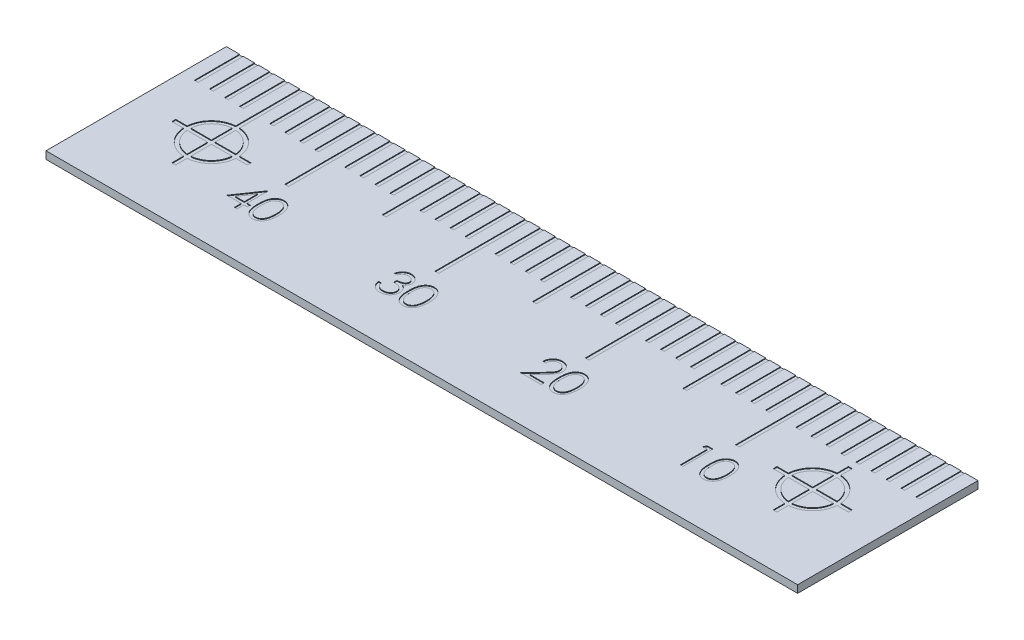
from build123d import *

# Parameters (mm, degrees)
SKETCH1_W           = 50
SKETCH1_H           = 12
BOSS_EXTRUDE1_DEPTH = 0.5
SKETCH2_W           = 0.25
SKETCH2_H           = 3
CUT_EXTRUDE2_DEPTH  = 0.05
LPATTERN2_COUNT     = 49
LPATTERN2_PITCH     = 1
SKETCH3_W           = 0.25
SKETCH3_H           = 3
CUT_EXTRUDE3_DEPTH  = 0.05
LPATTERN3_COUNT     = 4
LPATTERN3_PITCH     = 10
SKETCH4_W           = 0.25
SKETCH4_H           = 1.5
CUT_EXTRUDE4_DEPTH  = 0.05
LPATTERN4_COUNT     = 3
LPATTERN4_PITCH     = 10
LPATTERN4_COL_COUNT = 2
LPATTERN4_COL_PITCH = 10
CUT_EXTRUDE6_DEPTH  = 0.05
LPATTERN5_COUNT     = 2
LPATTERN5_PITCH     = 40
CUT_EXTRUDE12_DEPTH = 0.05


with BuildPart() as part:
    # Sketch1 → Boss-Extrude1 (new body)
    with BuildSketch(Plane(origin=(0, 0, 0), x_dir=(1, 0, 0), z_dir=(0, 1, 0))):
        Rectangle(SKETCH1_W, SKETCH1_H)
    extrude(amount=-BOSS_EXTRUDE1_DEPTH)

    # Sketch2 → Cut-Extrude2 (cut)
    with BuildSketch(Plane(origin=(0, 0, 0), x_dir=(1, 0, 0), z_dir=(0, 1, 0))):
        with Locations((-24, 4.5)):
            Rectangle(SKETCH2_W, SKETCH2_H)
    cut_extrude2 = extrude(amount=-CUT_EXTRUDE2_DEPTH, mode=Mode.SUBTRACT)

    # LPattern2: Cut-Extrude2 ×49
    with Locations(*[(i * LPATTERN2_PITCH, 0, 0) for i in range(1, LPATTERN2_COUNT)]):
        add(cut_extrude2, mode=Mode.SUBTRACT)

    # Sketch3 → Cut-Extrude3 (cut)
    with BuildSketch(Plane(origin=(0, 0, 0), x_dir=(1, 0, 0), z_dir=(0, 1, 0))):
        with Locations((-15, 1.5)):
            Rectangle(SKETCH3_W, SKETCH3_H)
    cut_extrude3 = extrude(amount=-CUT_EXTRUDE3_DEPTH, mode=Mode.SUBTRACT)

    # LPattern3: Cut-Extrude3 ×4
    with Locations(*[(i * LPATTERN3_PITCH, 0, 0) for i in range(1, LPATTERN3_COUNT)]):
        add(cut_extrude3, mode=Mode.SUBTRACT)

    # Sketch4 → Cut-Extrude4 (cut)
    with BuildSketch(Plane(origin=(0, 0, 0), x_dir=(1, 0, 0), z_dir=(0, 1, 0))):
        with Locations((-10, 2.25)):
            Rectangle(SKETCH4_W, SKETCH4_H)
    cut_extrude4 = extrude(amount=-CUT_EXTRUDE4_DEPTH, mode=Mode.SUBTRACT)

    # LPattern4: Cut-Extrude4 ×3
    with Locations(*[(i * LPATTERN4_PITCH, 0, 0) for i in range(1, LPATTERN4_COUNT)]):
        add(cut_extrude4, mode=Mode.SUBTRACT)

    # LPattern4 col: Cut-Extrude4 ×2
    with Locations(*[(-i * LPATTERN4_COL_PITCH, 0, 0) for i in range(1, LPATTERN4_COL_COUNT)]):
        add(cut_extrude4, mode=Mode.SUBTRACT)

    # Sketch5 → Cut-Extrude6 (cut)
    with BuildSketch(Plane(origin=(0, 0, 0), x_dir=(1, 0, 0), z_dir=(0, 1, 0))):
        with BuildLine():
            Line((-20.12, 2.5), (-19.87, 2.5))
            Line((-19.87, 2.5), (-19.87, 1.745530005))
            ThreePointArc((-19.87, 1.745530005), (-18.757563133, 1.237436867), (-18.249469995, 0.125))
            Line((-18.249469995, 0.125), (-17.495, 0.125))
            Line((-17.495, 0.125), (-17.495, -0.125))
            Line((-17.495, -0.125), (-18.249469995, -0.125))
            ThreePointArc((-18.249469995, -0.125), (-18.757563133, -1.237436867), (-19.87, -1.745530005))
            Line((-19.87, -1.745530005), (-19.87, -2.5))
            Line((-19.87, -2.5), (-20.12, -2.5))
            Line((-20.12, -2.5), (-20.12, -1.745530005))
            ThreePointArc((-20.12, -1.745530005), (-21.232436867, -1.237436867), (-21.740530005, -0.125))
            Line((-21.740530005, -0.125), (-22.495, -0.125))
            Line((-22.495, -0.125), (-22.495, 0.125))
            Line((-22.495, 0.125), (-21.740530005, 0.125))
            ThreePointArc((-21.740530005, 0.125), (-21.232436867, 1.237436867), (-20.12, 1.745530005))
            Line((-20.12, 1.745530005), (-20.12, 2.5))
        make_face()
        with BuildLine():
            Line((-20.12, 1.494782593), (-20.12, 0.125))
            Line((-20.12, 0.125), (-21.489782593, 0.125))
            ThreePointArc((-21.489782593, 0.125), (-21.055660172, 1.060660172), (-20.12, 1.494782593))
        make_face(mode=Mode.SUBTRACT)
        with BuildLine():
            Line((-19.87, 1.494782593), (-19.87, 0.125))
            Line((-19.87, 0.125), (-18.500217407, 0.125))
            ThreePointArc((-18.500217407, 0.125), (-18.934339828, 1.060660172), (-19.87, 1.494782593))
        make_face(mode=Mode.SUBTRACT)
        with BuildLine():
            Line((-21.489782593, -0.125), (-20.12, -0.125))
            Line((-20.12, -0.125), (-20.12, -1.494782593))
            ThreePointArc((-20.12, -1.494782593), (-21.055660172, -1.060660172), (-21.489782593, -0.125))
        make_face(mode=Mode.SUBTRACT)
        with BuildLine():
            Line((-19.87, -0.125), (-19.87, -1.494782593))
            ThreePointArc((-19.87, -1.494782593), (-18.934339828, -1.060660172), (-18.500217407, -0.125))
            Line((-18.500217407, -0.125), (-19.87, -0.125))
        make_face(mode=Mode.SUBTRACT)
    cut_extrude6 = extrude(amount=-CUT_EXTRUDE6_DEPTH, mode=Mode.SUBTRACT)

    # LPattern5: Cut-Extrude6 ×2
    with Locations(*[(i * LPATTERN5_PITCH, 0, 0) for i in range(1, LPATTERN5_COUNT)]):
        add(cut_extrude6, mode=Mode.SUBTRACT)

    # Sketch15 → Cut-Extrude12 (cut)
    # profile 1 of 8: a face of its own
    with BuildSketch(Plane(origin=(0, 0, 0), x_dir=(1, 0, 0), z_dir=(0, 1, 0))):
        Polygon((-15.331330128, -0.948717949), (-15.294871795, -0.948717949), (-15.294871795, -2.333333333), (-15.064102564, -2.333333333), (-15.064102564, -2.538461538), (-15.294871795, -2.538461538), (-15.294871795, -3), (-15.474358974, -3), (-15.474358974, -2.538461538), (-16.423076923, -2.538461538), align=None)
        Polygon((-15.474358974, -2.333333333), (-15.474358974, -1.46474359), (-16.070512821, -2.333333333), align=None, mode=Mode.SUBTRACT)
    # profile 2 of 8: a face of its own
    with BuildSketch(Plane(origin=(0, 0, 0), x_dir=(1, 0, 0), z_dir=(0, 1, 0))):
        with BuildLine():
            add(Edge.make_bspline(
                [(-14.884615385, -2.000801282), (-14.884427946, -1.968745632), (-14.884063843, -1.906477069), (-14.880013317, -1.815742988), (-14.87328455, -1.730622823), (-14.864063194, -1.6511125), (-14.852841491, -1.577191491), (-14.837861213, -1.509057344), (-14.820825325, -1.446394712), (-14.801081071, -1.388999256), (-14.778802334, -1.336097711), (-14.754554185, -1.286711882), (-14.727374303, -1.240916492), (-14.698816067, -1.197980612), (-14.667723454, -1.158607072), (-14.634981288, -1.122239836), (-14.599311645, -1.089719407), (-14.561927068, -1.060092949), (-14.522489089, -1.034121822), (-14.482121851, -1.011245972), (-14.440547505, -0.99170319), (-14.397652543, -0.976337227), (-14.35382251, -0.963645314), (-14.308904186, -0.954965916), (-14.262823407, -0.949504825), (-14.23171973, -0.948982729), (-14.215945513, -0.948717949)],
                knots=[0, 0, 0, 0, 1.646270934, 3.197905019, 4.663502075, 6.030701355, 7.308322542, 8.50163776, 9.611534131, 10.641858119, 11.616356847, 12.558055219, 13.465016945, 14.349605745, 15.204443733, 16.039544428, 16.859896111, 17.680448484, 18.487036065, 19.28249412, 20.06191084, 20.843045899, 21.620316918, 22.403196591, 23.190181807, 24, 24, 24, 24], degree=3))
            add(Edge.make_bspline(
                [(-14.215945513, -0.948717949), (-14.200039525, -0.9489967), (-14.16840752, -0.949551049), (-14.121641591, -0.954879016), (-14.075956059, -0.963719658), (-14.031545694, -0.976245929), (-13.988045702, -0.991786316), (-13.945796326, -1.011264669), (-13.904535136, -1.033938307), (-13.864917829, -1.060580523), (-13.826509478, -1.090284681), (-13.790253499, -1.123863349), (-13.756146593, -1.160977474), (-13.723760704, -1.201229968), (-13.694014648, -1.245392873), (-13.665686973, -1.292698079), (-13.640331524, -1.343972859), (-13.615911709, -1.398361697), (-13.594833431, -1.457369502), (-13.575824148, -1.520663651), (-13.560464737, -1.588991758), (-13.547670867, -1.661995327), (-13.537759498, -1.73994246), (-13.530540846, -1.822666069), (-13.526727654, -1.910220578), (-13.526009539, -1.970082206), (-13.525641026, -2.000801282)],
                knots=[0, 0, 0, 0, 0.810914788, 1.612654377, 2.396697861, 3.181598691, 3.963628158, 4.749916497, 5.551656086, 6.361998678, 7.18212741, 8.025565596, 8.878627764, 9.750805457, 10.657531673, 11.591944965, 12.560506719, 13.57287815, 14.630710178, 15.753379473, 16.941251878, 18.199788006, 19.531962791, 20.947069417, 22.433333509, 24, 24, 24, 24], degree=3))
            add(Edge.make_bspline(
                [(-13.525641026, -2.000801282), (-13.52601336, -2.031386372), (-13.526738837, -2.090980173), (-13.530498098, -2.178140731), (-13.53790303, -2.260425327), (-13.547165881, -2.338031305), (-13.559995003, -2.410635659), (-13.575769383, -2.47848963), (-13.593283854, -2.541886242), (-13.614903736, -2.600306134), (-13.638566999, -2.654564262), (-13.664312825, -2.705231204), (-13.691895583, -2.752754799), (-13.721946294, -2.796754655), (-13.753976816, -2.837542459), (-13.788672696, -2.874398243), (-13.825055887, -2.908210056), (-13.863577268, -2.9382967), (-13.90381244, -2.964630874), (-13.944931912, -2.988181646), (-13.987665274, -3.007171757), (-14.031044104, -3.023477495), (-14.075688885, -3.035934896), (-14.121543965, -3.044548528), (-14.1683761, -3.050589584), (-14.200034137, -3.05105043), (-14.215945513, -3.051282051)],
                knots=[0, 0, 0, 0, 1.561518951, 3.042555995, 4.452378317, 5.7783523, 7.031515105, 8.214008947, 9.334062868, 10.386615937, 11.391082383, 12.354592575, 13.286541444, 14.194233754, 15.072674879, 15.931287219, 16.775624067, 17.606195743, 18.42308326, 19.229000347, 20.022332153, 20.807536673, 21.593273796, 22.3848459, 23.188221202, 24, 24, 24, 24], degree=3))
            add(Edge.make_bspline(
                [(-14.215945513, -3.051282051), (-14.231719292, -3.051015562), (-14.262822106, -3.050490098), (-14.308909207, -3.04505368), (-14.353642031, -3.036313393), (-14.397241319, -3.024075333), (-14.439930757, -3.009095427), (-14.481128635, -2.989579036), (-14.521293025, -2.967102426), (-14.560316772, -2.941505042), (-14.597466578, -2.912178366), (-14.632951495, -2.879741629), (-14.665880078, -2.843385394), (-14.696528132, -2.803683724), (-14.725656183, -2.761001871), (-14.75245011, -2.714757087), (-14.777233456, -2.665132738), (-14.799886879, -2.611808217), (-14.819971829, -2.554005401), (-14.837713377, -2.491063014), (-14.851721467, -2.422425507), (-14.863711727, -2.348644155), (-14.873382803, -2.269401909), (-14.879985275, -2.18465575), (-14.884066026, -2.094458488), (-14.884428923, -2.032590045), (-14.884615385, -2.000801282)],
                knots=[0, 0, 0, 0, 0.810891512, 1.598919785, 2.382837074, 3.152667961, 3.926044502, 4.706494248, 5.493654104, 6.291793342, 7.103789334, 7.925228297, 8.761435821, 9.622817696, 10.50288917, 11.416980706, 12.369136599, 13.353924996, 14.394355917, 15.514179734, 16.714354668, 17.994756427, 19.357759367, 20.818452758, 22.365282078, 24, 24, 24, 24], degree=3))
        make_face()
        with BuildLine():
            add(Edge.make_bspline(
                [(-14.705128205, -2), (-14.70505995, -2.026713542), (-14.704927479, -2.078559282), (-14.701466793, -2.153898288), (-14.696752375, -2.224167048), (-14.690671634, -2.289454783), (-14.681641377, -2.349540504), (-14.671523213, -2.404837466), (-14.659210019, -2.45505303), (-14.644641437, -2.500531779), (-14.628047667, -2.542045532), (-14.609930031, -2.580674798), (-14.590466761, -2.616875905), (-14.568684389, -2.650323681), (-14.544961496, -2.681127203), (-14.519833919, -2.709831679), (-14.492363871, -2.735429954), (-14.454361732, -2.766131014), (-14.404192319, -2.797856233), (-14.34098063, -2.82548257), (-14.276027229, -2.842843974), (-14.231940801, -2.845051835), (-14.209935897, -2.846153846)],
                knots=[0, 0, 0, 0, 1.459021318, 2.831673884, 4.118529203, 5.306027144, 6.411944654, 7.436330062, 8.375795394, 9.233974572, 10.042671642, 10.816086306, 11.563610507, 12.285937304, 12.993564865, 13.685989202, 14.367179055, 15.041617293, 16.353048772, 17.594441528, 18.799311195, 20, 20, 20, 20], degree=3))
            add(Edge.make_bspline(
                [(-14.209935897, -2.846153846), (-14.187788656, -2.845240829), (-14.1435399, -2.843416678), (-14.078892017, -2.8258174), (-14.016131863, -2.799263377), (-13.966947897, -2.767864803), (-13.929529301, -2.7379629), (-13.902719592, -2.712468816), (-13.878112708, -2.683922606), (-13.854774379, -2.653123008), (-13.833369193, -2.619481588), (-13.813904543, -2.583160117), (-13.79614263, -2.544057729), (-13.786023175, -2.516760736), (-13.780849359, -2.502804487)],
                knots=[0, 0, 0, 0, 1.353760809, 2.704726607, 4.075137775, 5.516104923, 6.260822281, 7.007110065, 7.778089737, 8.566572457, 9.372053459, 10.217411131, 11.088608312, 12, 12, 12, 12], degree=3))
            add(Edge.make_bspline(
                [(-13.780849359, -2.502804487), (-13.774819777, -2.484958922), (-13.762577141, -2.448724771), (-13.746798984, -2.39251697), (-13.734373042, -2.333543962), (-13.723193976, -2.272158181), (-13.715563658, -2.207906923), (-13.70942205, -2.140988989), (-13.705804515, -2.071353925), (-13.705356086, -2.024042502), (-13.705128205, -2)],
                knots=[0, 0, 0, 0, 0.884706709, 1.796334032, 2.740027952, 3.714592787, 4.726048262, 5.777819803, 6.87074269, 8, 8, 8, 8], degree=3))
            add(Edge.make_bspline(
                [(-13.705128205, -2), (-13.705442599, -1.975961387), (-13.706057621, -1.928936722), (-13.708408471, -1.86006919), (-13.714479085, -1.794659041), (-13.721221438, -1.732424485), (-13.731162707, -1.673710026), (-13.741881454, -1.618024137), (-13.756282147, -1.566056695), (-13.771664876, -1.516994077), (-13.789270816, -1.471393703), (-13.808651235, -1.429042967), (-13.829349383, -1.38973741), (-13.851830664, -1.353584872), (-13.875828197, -1.320423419), (-13.901975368, -1.290917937), (-13.929235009, -1.264153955), (-13.967416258, -1.233603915), (-14.017401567, -1.202454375), (-14.07959908, -1.173788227), (-14.144325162, -1.157326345), (-14.188081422, -1.155005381), (-14.209935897, -1.153846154)],
                knots=[0, 0, 0, 0, 1.31362396, 2.569729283, 3.763502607, 4.902122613, 5.988968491, 7.01645872, 7.998833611, 8.933434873, 9.825090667, 10.667526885, 11.477055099, 12.250526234, 12.991942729, 13.710640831, 14.402115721, 15.076753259, 16.378508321, 17.609869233, 18.806226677, 20, 20, 20, 20], degree=3))
            add(Edge.make_bspline(
                [(-14.209935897, -1.153846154), (-14.232056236, -1.155006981), (-14.27633721, -1.157330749), (-14.341736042, -1.173726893), (-14.404424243, -1.202305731), (-14.454277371, -1.233707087), (-14.492485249, -1.263614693), (-14.519389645, -1.28954981), (-14.544616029, -1.317919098), (-14.567854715, -1.349005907), (-14.58962002, -1.382414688), (-14.60960917, -1.418408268), (-14.627619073, -1.457169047), (-14.644238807, -1.498664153), (-14.658851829, -1.544138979), (-14.670905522, -1.594292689), (-14.682040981, -1.64941377), (-14.689923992, -1.709824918), (-14.696931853, -1.775129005), (-14.70143548, -1.845573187), (-14.704939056, -1.921038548), (-14.705063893, -1.973152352), (-14.705128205, -2)],
                knots=[0, 0, 0, 0, 1.207732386, 2.417664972, 3.655092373, 4.956220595, 5.625982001, 6.301752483, 6.994047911, 7.697131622, 8.419323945, 9.170223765, 9.943494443, 10.752040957, 11.610060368, 12.549350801, 13.567764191, 14.679664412, 15.874934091, 17.154273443, 18.533957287, 20, 20, 20, 20], degree=3))
        make_face(mode=Mode.SUBTRACT)
    # profile 3 of 8: a face of its own
    with BuildSketch(Plane(origin=(0, 0, 0), x_dir=(1, 0, 0), z_dir=(0, 1, 0))):
        with BuildLine():
            Line((-6.166666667, -1.461538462), (-6.346153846, -1.461538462))
            add(Edge.make_bspline(
                [(-6.346153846, -1.461538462), (-6.341291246, -1.441405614), (-6.33178526, -1.402047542), (-6.311958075, -1.345814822), (-6.2903585, -1.292601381), (-6.264421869, -1.243403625), (-6.236131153, -1.197232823), (-6.203718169, -1.155136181), (-6.168678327, -1.116043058), (-6.129921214, -1.081349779), (-6.089276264, -1.049933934), (-6.046170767, -1.023148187), (-6.001471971, -1.000105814), (-5.95487018, -0.981122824), (-5.906226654, -0.966822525), (-5.855981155, -0.956447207), (-5.804002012, -0.949709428), (-5.768717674, -0.949051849), (-5.750801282, -0.948717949)],
                knots=[0, 0, 0, 0, 1.162005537, 2.271625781, 3.343758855, 4.383309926, 5.390229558, 6.379919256, 7.361854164, 8.333198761, 9.295911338, 10.242430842, 11.177959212, 12.116337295, 13.062827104, 14.020064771, 14.994644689, 16, 16, 16, 16], degree=3))
            add(Edge.make_bspline(
                [(-5.750801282, -0.948717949), (-5.724696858, -0.94950608), (-5.673057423, -0.951065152), (-5.597192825, -0.965301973), (-5.524034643, -0.98783062), (-5.454383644, -1.018958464), (-5.389687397, -1.057351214), (-5.332123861, -1.10304535), (-5.282473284, -1.155159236), (-5.240819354, -1.212720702), (-5.208205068, -1.274238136), (-5.184155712, -1.337552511), (-5.169514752, -1.402513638), (-5.167617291, -1.44637494), (-5.166666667, -1.468349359)],
                knots=[0, 0, 0, 0, 1.083050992, 2.142477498, 3.193116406, 4.255571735, 5.30263384, 6.308962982, 7.297363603, 8.282367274, 9.249857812, 10.179914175, 11.08814088, 12, 12, 12, 12], degree=3))
            add(Edge.make_bspline(
                [(-5.166666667, -1.468349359), (-5.167331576, -1.489496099), (-5.1686327, -1.530876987), (-5.179680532, -1.591289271), (-5.198272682, -1.648227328), (-5.224026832, -1.70193085), (-5.257364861, -1.75205933), (-5.297749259, -1.798725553), (-5.345465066, -1.8421365), (-5.381624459, -1.867004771), (-5.400240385, -1.879807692)],
                knots=[0, 0, 0, 0, 1.024540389, 2.004866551, 2.965041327, 3.920577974, 4.882998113, 5.874504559, 6.905732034, 8, 8, 8, 8], degree=3))
            add(Edge.make_bspline(
                [(-5.400240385, -1.879807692), (-5.378965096, -1.890080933), (-5.336812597, -1.910435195), (-5.279355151, -1.95035277), (-5.227196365, -1.996442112), (-5.198108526, -2.032409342), (-5.18349359, -2.050480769)],
                knots=[0, 0, 0, 0, 1.015518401, 2.012035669, 3.001164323, 4, 4, 4, 4], degree=3))
            add(Edge.make_bspline(
                [(-5.18349359, -2.050480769), (-5.173869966, -2.063656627), (-5.154780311, -2.08979258), (-5.131217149, -2.131813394), (-5.109840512, -2.17429996), (-5.093183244, -2.218391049), (-5.080283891, -2.263575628), (-5.071063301, -2.309931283), (-5.065335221, -2.357495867), (-5.064514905, -2.389674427), (-5.064102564, -2.405849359)],
                knots=[0, 0, 0, 0, 1.025084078, 2.033381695, 3.024893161, 4.013698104, 4.991890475, 5.976764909, 6.982997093, 8, 8, 8, 8], degree=3))
            add(Edge.make_bspline(
                [(-5.064102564, -2.405849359), (-5.065128, -2.433854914), (-5.067174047, -2.489734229), (-5.08546209, -2.572291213), (-5.113812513, -2.6529915), (-5.154073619, -2.730177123), (-5.203140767, -2.802394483), (-5.261516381, -2.867009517), (-5.328537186, -2.922551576), (-5.403283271, -2.968957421), (-5.484264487, -3.006053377), (-5.570879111, -3.031800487), (-5.661879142, -3.048569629), (-5.724283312, -3.05036784), (-5.756009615, -3.051282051)],
                knots=[0, 0, 0, 0, 0.955779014, 1.907060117, 2.875433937, 3.871313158, 4.872415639, 5.851225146, 6.836215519, 7.83643374, 8.849228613, 9.86973379, 10.916971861, 12, 12, 12, 12], degree=3))
            add(Edge.make_bspline(
                [(-5.756009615, -3.051282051), (-5.777392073, -3.050785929), (-5.819465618, -3.049809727), (-5.881319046, -3.043136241), (-5.940360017, -3.030947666), (-5.996668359, -3.014545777), (-6.050294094, -2.993750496), (-6.101073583, -2.967854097), (-6.149319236, -2.937390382), (-6.194575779, -2.90199976), (-6.236837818, -2.862410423), (-6.274982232, -2.81791956), (-6.309644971, -2.769349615), (-6.339897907, -2.71613644), (-6.367119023, -2.658967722), (-6.389508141, -2.597111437), (-6.40921418, -2.531120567), (-6.41837616, -2.485133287), (-6.423076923, -2.461538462)],
                knots=[0, 0, 0, 0, 1.048658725, 2.063410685, 3.046034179, 4.001477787, 4.936774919, 5.862367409, 6.792675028, 7.730719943, 8.675894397, 9.627829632, 10.600096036, 11.597688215, 12.626045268, 13.701542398, 14.82072376, 16, 16, 16, 16], degree=3))
            Line((-6.423076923, -2.461538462), (-6.243589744, -2.461538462))
            add(Edge.make_bspline(
                [(-6.243589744, -2.461538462), (-6.238913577, -2.476937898), (-6.229818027, -2.506891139), (-6.214335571, -2.549999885), (-6.196696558, -2.589518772), (-6.177773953, -2.625737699), (-6.157900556, -2.659013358), (-6.135663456, -2.688465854), (-6.112709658, -2.715388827), (-6.095407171, -2.730557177), (-6.086939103, -2.737980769)],
                knots=[0, 0, 0, 0, 1.198163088, 2.33053128, 3.407730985, 4.417276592, 5.372219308, 6.28897303, 7.162600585, 8, 8, 8, 8], degree=3))
            add(Edge.make_bspline(
                [(-6.086939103, -2.737980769), (-6.075741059, -2.746614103), (-6.053379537, -2.763854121), (-6.016940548, -2.785855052), (-5.978617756, -2.804918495), (-5.937580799, -2.819480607), (-5.894715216, -2.831810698), (-5.84932815, -2.839879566), (-5.801820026, -2.845415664), (-5.769381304, -2.845904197), (-5.752804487, -2.846153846)],
                knots=[0, 0, 0, 0, 0.946170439, 1.889420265, 2.845303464, 3.807233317, 4.801018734, 5.828864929, 6.890507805, 8, 8, 8, 8], degree=3))
            add(Edge.make_bspline(
                [(-5.752804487, -2.846153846), (-5.7340882, -2.8458019), (-5.697490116, -2.845113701), (-5.644087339, -2.838784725), (-5.593283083, -2.829567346), (-5.545641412, -2.815331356), (-5.500538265, -2.797742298), (-5.458605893, -2.775657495), (-5.419293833, -2.749746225), (-5.383105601, -2.720295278), (-5.350565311, -2.688054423), (-5.321914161, -2.654332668), (-5.297557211, -2.619272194), (-5.277909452, -2.582678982), (-5.262394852, -2.544704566), (-5.251833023, -2.505242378), (-5.2444893, -2.464615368), (-5.243891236, -2.436998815), (-5.243589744, -2.423076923)],
                knots=[0, 0, 0, 0, 1.217147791, 2.380027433, 3.494444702, 4.572153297, 5.609568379, 6.639424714, 7.649109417, 8.668170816, 9.669597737, 10.625200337, 11.543417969, 12.441394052, 13.322311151, 14.205496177, 15.095365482, 16, 16, 16, 16], degree=3))
            add(Edge.make_bspline(
                [(-5.243589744, -2.423076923), (-5.244464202, -2.404441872), (-5.246208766, -2.367264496), (-5.259527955, -2.312568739), (-5.281435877, -2.259869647), (-5.312105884, -2.210066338), (-5.349440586, -2.16390868), (-5.393077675, -2.122724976), (-5.44337952, -2.088742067), (-5.489676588, -2.065262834), (-5.530685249, -2.049241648), (-5.565779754, -2.03857024), (-5.605069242, -2.029533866), (-5.648078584, -2.021126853), (-5.695131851, -2.013971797), (-5.746177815, -2.008005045), (-5.801226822, -2.003230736), (-5.83933606, -2.001098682), (-5.858974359, -2)],
                knots=[0, 0, 0, 0, 1.07054697, 2.135767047, 3.216561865, 4.33974944, 5.486079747, 6.621378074, 7.775625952, 8.963672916, 9.598146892, 10.304877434, 11.070270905, 11.915000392, 12.823868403, 13.805723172, 14.86925407, 16, 16, 16, 16], degree=3))
            Line((-5.858974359, -2), (-5.858974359, -1.794871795))
            add(Edge.make_bspline(
                [(-5.858974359, -1.794871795), (-5.834230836, -1.794451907), (-5.785764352, -1.79362945), (-5.714967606, -1.783682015), (-5.647268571, -1.769921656), (-5.584167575, -1.748844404), (-5.526654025, -1.724364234), (-5.476757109, -1.695877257), (-5.435175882, -1.664211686), (-5.402112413, -1.628878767), (-5.377238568, -1.590984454), (-5.359051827, -1.551489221), (-5.348308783, -1.5100469), (-5.346874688, -1.481764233), (-5.346153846, -1.467548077)],
                knots=[0, 0, 0, 0, 1.321986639, 2.589447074, 3.816329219, 5.01088745, 6.139805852, 7.153945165, 8.075214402, 8.924034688, 9.728124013, 10.488707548, 11.240355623, 12, 12, 12, 12], degree=3))
            add(Edge.make_bspline(
                [(-5.346153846, -1.467548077), (-5.346390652, -1.457103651), (-5.346861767, -1.436324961), (-5.352803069, -1.405967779), (-5.361731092, -1.376538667), (-5.374005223, -1.348162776), (-5.390433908, -1.321036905), (-5.410094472, -1.294929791), (-5.433504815, -1.269990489), (-5.460330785, -1.246744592), (-5.48913753, -1.224590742), (-5.52070883, -1.20578295), (-5.554092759, -1.189700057), (-5.589326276, -1.176437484), (-5.626523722, -1.166460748), (-5.665510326, -1.15929741), (-5.706360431, -1.154818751), (-5.734229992, -1.154173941), (-5.748397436, -1.153846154)],
                knots=[0, 0, 0, 0, 0.884392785, 1.759457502, 2.611959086, 3.489218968, 4.37281399, 5.2945488, 6.255912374, 7.266815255, 8.301784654, 9.332968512, 10.37626691, 11.440494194, 12.520033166, 13.637162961, 14.798855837, 16, 16, 16, 16], degree=3))
            add(Edge.make_bspline(
                [(-5.748397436, -1.153846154), (-5.771169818, -1.154641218), (-5.815649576, -1.156194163), (-5.879772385, -1.169795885), (-5.939383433, -1.191497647), (-5.984948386, -1.217402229), (-6.018595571, -1.242973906), (-6.042639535, -1.265306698), (-6.066251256, -1.290125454), (-6.087877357, -1.318958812), (-6.109748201, -1.34985412), (-6.129659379, -1.384381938), (-6.149007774, -1.421641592), (-6.160666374, -1.447981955), (-6.166666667, -1.461538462)],
                knots=[0, 0, 0, 0, 1.472543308, 2.876219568, 4.221790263, 5.565193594, 6.249813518, 6.953379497, 7.687249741, 8.463570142, 9.283606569, 10.136032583, 11.040678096, 12, 12, 12, 12], degree=3))
        make_face()
    # profile 4 of 8: a face of its own
    with BuildSketch(Plane(origin=(0, 0, 0), x_dir=(1, 0, 0), z_dir=(0, 1, 0))):
        with BuildLine():
            add(Edge.make_bspline(
                [(-4.884615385, -2.000801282), (-4.884427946, -1.968745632), (-4.884063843, -1.906477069), (-4.880013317, -1.815742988), (-4.87328455, -1.730622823), (-4.864063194, -1.6511125), (-4.852841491, -1.577191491), (-4.837861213, -1.509057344), (-4.820825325, -1.446394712), (-4.801081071, -1.388999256), (-4.778802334, -1.336097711), (-4.754554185, -1.286711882), (-4.727374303, -1.240916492), (-4.698816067, -1.197980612), (-4.667723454, -1.158607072), (-4.634981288, -1.122239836), (-4.599311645, -1.089719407), (-4.561927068, -1.060092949), (-4.522489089, -1.034121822), (-4.482121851, -1.011245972), (-4.440547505, -0.99170319), (-4.397652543, -0.976337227), (-4.35382251, -0.963645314), (-4.308904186, -0.954965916), (-4.262823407, -0.949504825), (-4.23171973, -0.948982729), (-4.215945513, -0.948717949)],
                knots=[0, 0, 0, 0, 1.646270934, 3.197905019, 4.663502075, 6.030701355, 7.308322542, 8.50163776, 9.611534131, 10.641858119, 11.616356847, 12.558055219, 13.465016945, 14.349605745, 15.204443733, 16.039544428, 16.859896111, 17.680448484, 18.487036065, 19.28249412, 20.06191084, 20.843045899, 21.620316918, 22.403196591, 23.190181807, 24, 24, 24, 24], degree=3))
            add(Edge.make_bspline(
                [(-4.215945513, -0.948717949), (-4.200039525, -0.9489967), (-4.16840752, -0.949551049), (-4.121641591, -0.954879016), (-4.075956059, -0.963719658), (-4.031545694, -0.976245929), (-3.988045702, -0.991786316), (-3.945796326, -1.011264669), (-3.904535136, -1.033938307), (-3.864917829, -1.060580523), (-3.826509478, -1.090284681), (-3.790253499, -1.123863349), (-3.756146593, -1.160977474), (-3.723760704, -1.201229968), (-3.694014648, -1.245392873), (-3.665686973, -1.292698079), (-3.640331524, -1.343972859), (-3.615911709, -1.398361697), (-3.594833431, -1.457369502), (-3.575824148, -1.520663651), (-3.560464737, -1.588991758), (-3.547670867, -1.661995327), (-3.537759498, -1.73994246), (-3.530540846, -1.822666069), (-3.526727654, -1.910220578), (-3.526009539, -1.970082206), (-3.525641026, -2.000801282)],
                knots=[0, 0, 0, 0, 0.810914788, 1.612654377, 2.396697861, 3.181598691, 3.963628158, 4.749916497, 5.551656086, 6.361998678, 7.18212741, 8.025565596, 8.878627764, 9.750805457, 10.657531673, 11.591944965, 12.560506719, 13.57287815, 14.630710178, 15.753379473, 16.941251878, 18.199788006, 19.531962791, 20.947069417, 22.433333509, 24, 24, 24, 24], degree=3))
            add(Edge.make_bspline(
                [(-3.525641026, -2.000801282), (-3.52601336, -2.031386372), (-3.526738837, -2.090980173), (-3.530498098, -2.178140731), (-3.53790303, -2.260425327), (-3.547165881, -2.338031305), (-3.559995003, -2.410635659), (-3.575769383, -2.47848963), (-3.593283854, -2.541886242), (-3.614903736, -2.600306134), (-3.638566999, -2.654564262), (-3.664312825, -2.705231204), (-3.691895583, -2.752754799), (-3.721946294, -2.796754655), (-3.753976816, -2.837542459), (-3.788672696, -2.874398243), (-3.825055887, -2.908210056), (-3.863577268, -2.9382967), (-3.90381244, -2.964630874), (-3.944931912, -2.988181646), (-3.987665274, -3.007171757), (-4.031044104, -3.023477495), (-4.075688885, -3.035934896), (-4.121543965, -3.044548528), (-4.1683761, -3.050589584), (-4.200034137, -3.05105043), (-4.215945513, -3.051282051)],
                knots=[0, 0, 0, 0, 1.561518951, 3.042555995, 4.452378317, 5.7783523, 7.031515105, 8.214008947, 9.334062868, 10.386615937, 11.391082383, 12.354592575, 13.286541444, 14.194233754, 15.072674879, 15.931287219, 16.775624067, 17.606195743, 18.42308326, 19.229000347, 20.022332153, 20.807536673, 21.593273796, 22.3848459, 23.188221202, 24, 24, 24, 24], degree=3))
            add(Edge.make_bspline(
                [(-4.215945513, -3.051282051), (-4.231719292, -3.051015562), (-4.262822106, -3.050490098), (-4.308909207, -3.04505368), (-4.353642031, -3.036313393), (-4.397241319, -3.024075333), (-4.439930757, -3.009095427), (-4.481128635, -2.989579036), (-4.521293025, -2.967102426), (-4.560316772, -2.941505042), (-4.597466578, -2.912178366), (-4.632951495, -2.879741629), (-4.665880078, -2.843385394), (-4.696528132, -2.803683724), (-4.725656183, -2.761001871), (-4.75245011, -2.714757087), (-4.777233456, -2.665132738), (-4.799886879, -2.611808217), (-4.819971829, -2.554005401), (-4.837713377, -2.491063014), (-4.851721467, -2.422425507), (-4.863711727, -2.348644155), (-4.873382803, -2.269401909), (-4.879985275, -2.18465575), (-4.884066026, -2.094458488), (-4.884428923, -2.032590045), (-4.884615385, -2.000801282)],
                knots=[0, 0, 0, 0, 0.810891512, 1.598919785, 2.382837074, 3.152667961, 3.926044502, 4.706494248, 5.493654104, 6.291793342, 7.103789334, 7.925228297, 8.761435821, 9.622817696, 10.50288917, 11.416980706, 12.369136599, 13.353924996, 14.394355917, 15.514179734, 16.714354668, 17.994756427, 19.357759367, 20.818452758, 22.365282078, 24, 24, 24, 24], degree=3))
        make_face()
        with BuildLine():
            add(Edge.make_bspline(
                [(-4.705128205, -2), (-4.70505995, -2.026713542), (-4.704927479, -2.078559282), (-4.701466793, -2.153898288), (-4.696752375, -2.224167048), (-4.690671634, -2.289454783), (-4.681641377, -2.349540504), (-4.671523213, -2.404837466), (-4.659210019, -2.45505303), (-4.644641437, -2.500531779), (-4.628047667, -2.542045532), (-4.609930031, -2.580674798), (-4.590466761, -2.616875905), (-4.568684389, -2.650323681), (-4.544961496, -2.681127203), (-4.519833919, -2.709831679), (-4.492363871, -2.735429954), (-4.454361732, -2.766131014), (-4.404192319, -2.797856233), (-4.34098063, -2.82548257), (-4.276027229, -2.842843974), (-4.231940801, -2.845051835), (-4.209935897, -2.846153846)],
                knots=[0, 0, 0, 0, 1.459021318, 2.831673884, 4.118529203, 5.306027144, 6.411944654, 7.436330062, 8.375795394, 9.233974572, 10.042671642, 10.816086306, 11.563610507, 12.285937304, 12.993564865, 13.685989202, 14.367179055, 15.041617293, 16.353048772, 17.594441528, 18.799311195, 20, 20, 20, 20], degree=3))
            add(Edge.make_bspline(
                [(-4.209935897, -2.846153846), (-4.187788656, -2.845240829), (-4.1435399, -2.843416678), (-4.078892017, -2.8258174), (-4.016131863, -2.799263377), (-3.966947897, -2.767864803), (-3.929529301, -2.7379629), (-3.902719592, -2.712468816), (-3.878112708, -2.683922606), (-3.854774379, -2.653123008), (-3.833369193, -2.619481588), (-3.813904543, -2.583160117), (-3.79614263, -2.544057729), (-3.786023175, -2.516760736), (-3.780849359, -2.502804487)],
                knots=[0, 0, 0, 0, 1.353760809, 2.704726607, 4.075137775, 5.516104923, 6.260822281, 7.007110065, 7.778089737, 8.566572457, 9.372053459, 10.217411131, 11.088608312, 12, 12, 12, 12], degree=3))
            add(Edge.make_bspline(
                [(-3.780849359, -2.502804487), (-3.774819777, -2.484958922), (-3.762577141, -2.448724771), (-3.746798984, -2.39251697), (-3.734373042, -2.333543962), (-3.723193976, -2.272158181), (-3.715563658, -2.207906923), (-3.70942205, -2.140988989), (-3.705804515, -2.071353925), (-3.705356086, -2.024042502), (-3.705128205, -2)],
                knots=[0, 0, 0, 0, 0.884706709, 1.796334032, 2.740027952, 3.714592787, 4.726048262, 5.777819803, 6.87074269, 8, 8, 8, 8], degree=3))
            add(Edge.make_bspline(
                [(-3.705128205, -2), (-3.705442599, -1.975961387), (-3.706057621, -1.928936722), (-3.708408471, -1.86006919), (-3.714479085, -1.794659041), (-3.721221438, -1.732424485), (-3.731162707, -1.673710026), (-3.741881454, -1.618024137), (-3.756282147, -1.566056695), (-3.771664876, -1.516994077), (-3.789270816, -1.471393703), (-3.808651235, -1.429042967), (-3.829349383, -1.38973741), (-3.851830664, -1.353584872), (-3.875828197, -1.320423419), (-3.901975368, -1.290917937), (-3.929235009, -1.264153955), (-3.967416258, -1.233603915), (-4.017401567, -1.202454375), (-4.07959908, -1.173788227), (-4.144325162, -1.157326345), (-4.188081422, -1.155005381), (-4.209935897, -1.153846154)],
                knots=[0, 0, 0, 0, 1.31362396, 2.569729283, 3.763502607, 4.902122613, 5.988968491, 7.01645872, 7.998833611, 8.933434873, 9.825090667, 10.667526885, 11.477055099, 12.250526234, 12.991942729, 13.710640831, 14.402115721, 15.076753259, 16.378508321, 17.609869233, 18.806226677, 20, 20, 20, 20], degree=3))
            add(Edge.make_bspline(
                [(-4.209935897, -1.153846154), (-4.232056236, -1.155006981), (-4.27633721, -1.157330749), (-4.341736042, -1.173726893), (-4.404424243, -1.202305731), (-4.454277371, -1.233707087), (-4.492485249, -1.263614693), (-4.519389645, -1.28954981), (-4.544616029, -1.317919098), (-4.567854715, -1.349005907), (-4.58962002, -1.382414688), (-4.60960917, -1.418408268), (-4.627619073, -1.457169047), (-4.644238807, -1.498664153), (-4.658851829, -1.544138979), (-4.670905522, -1.594292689), (-4.682040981, -1.64941377), (-4.689923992, -1.709824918), (-4.696931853, -1.775129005), (-4.70143548, -1.845573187), (-4.704939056, -1.921038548), (-4.705063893, -1.973152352), (-4.705128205, -2)],
                knots=[0, 0, 0, 0, 1.207732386, 2.417664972, 3.655092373, 4.956220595, 5.625982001, 6.301752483, 6.994047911, 7.697131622, 8.419323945, 9.170223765, 9.943494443, 10.752040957, 11.610060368, 12.549350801, 13.567764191, 14.679664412, 15.874934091, 17.154273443, 18.533957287, 20, 20, 20, 20], degree=3))
        make_face(mode=Mode.SUBTRACT)
    # profile 5 of 8: a face of its own
    with BuildSketch(Plane(origin=(0, 0, 0), x_dir=(1, 0, 0), z_dir=(0, 1, 0))):
        with BuildLine():
            Line((3.833333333, -1.615384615), (3.653846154, -1.615384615))
            add(Edge.make_bspline(
                [(3.653846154, -1.615384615), (3.655015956, -1.59157268), (3.657313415, -1.544806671), (3.668072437, -1.476621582), (3.683467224, -1.411447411), (3.70523377, -1.34980746), (3.732265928, -1.291156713), (3.764683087, -1.235728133), (3.803079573, -1.183733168), (3.846626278, -1.135653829), (3.893922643, -1.091546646), (3.944954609, -1.053457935), (3.998580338, -1.021276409), (4.054637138, -0.994372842), (4.11375746, -0.974178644), (4.175404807, -0.95919485), (4.239850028, -0.950179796), (4.283758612, -0.949210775), (4.306089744, -0.948717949)],
                knots=[0, 0, 0, 0, 1.10065271, 2.161652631, 3.183658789, 4.190468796, 5.17591951, 6.163126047, 7.15150782, 8.156236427, 9.156009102, 10.134482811, 11.092018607, 12.041330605, 13.001268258, 13.972401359, 14.968799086, 16, 16, 16, 16], degree=3))
            add(Edge.make_bspline(
                [(4.306089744, -0.948717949), (4.328020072, -0.949231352), (4.371112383, -0.950240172), (4.434004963, -0.958903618), (4.493877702, -0.972472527), (4.550613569, -0.991509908), (4.603759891, -1.017101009), (4.653715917, -1.04784246), (4.70107638, -1.083396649), (4.743708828, -1.125255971), (4.782856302, -1.169943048), (4.816629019, -1.217650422), (4.845550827, -1.266924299), (4.869658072, -1.318140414), (4.887404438, -1.371781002), (4.900877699, -1.427065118), (4.908493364, -1.48456501), (4.909662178, -1.523483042), (4.91025641, -1.543269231)],
                knots=[0, 0, 0, 0, 1.111607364, 2.184268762, 3.212621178, 4.221274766, 5.211760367, 6.196651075, 7.1921475, 8.207485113, 9.220403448, 10.201281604, 11.166441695, 12.114753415, 13.065576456, 14.026450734, 14.996634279, 16, 16, 16, 16], degree=3))
            add(Edge.make_bspline(
                [(4.91025641, -1.543269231), (4.909288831, -1.571125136), (4.907370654, -1.626348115), (4.890962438, -1.707499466), (4.865335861, -1.786124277), (4.834480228, -1.849402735), (4.803353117, -1.900393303), (4.775303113, -1.94237542), (4.742466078, -1.987578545), (4.704364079, -2.035851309), (4.661785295, -2.087571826), (4.614344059, -2.142708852), (4.561702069, -2.20069272), (4.524754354, -2.240295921), (4.505608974, -2.260817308)],
                knots=[0, 0, 0, 0, 1.184426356, 2.348067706, 3.509069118, 4.696110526, 5.333549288, 6.050745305, 6.844228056, 7.710549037, 8.667450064, 9.695053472, 10.805634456, 12, 12, 12, 12], degree=3))
            Line((4.505608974, -2.260817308), (4.005208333, -2.794871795))
            Line((4.005208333, -2.794871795), (4.935897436, -2.794871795))
            Line((4.935897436, -2.794871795), (4.935897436, -3))
            Line((4.935897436, -3), (3.576923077, -3))
            Line((3.576923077, -3), (4.352564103, -2.172275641))
            add(Edge.make_bspline(
                [(4.352564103, -2.172275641), (4.371448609, -2.152562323), (4.407721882, -2.114697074), (4.459026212, -2.059415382), (4.505105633, -2.00812993), (4.546258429, -1.960937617), (4.581591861, -1.917148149), (4.612947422, -1.878179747), (4.638070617, -1.842320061), (4.665336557, -1.800753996), (4.691744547, -1.750004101), (4.714437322, -1.68798485), (4.728274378, -1.624140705), (4.729934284, -1.580996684), (4.730769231, -1.559294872)],
                knots=[0, 0, 0, 0, 1.329631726, 2.553950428, 3.673215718, 4.687767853, 5.603093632, 6.413772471, 7.123043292, 7.734684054, 8.834405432, 9.900288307, 10.943827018, 12, 12, 12, 12], degree=3))
            add(Edge.make_bspline(
                [(4.730769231, -1.559294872), (4.730405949, -1.545648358), (4.729689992, -1.518753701), (4.723371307, -1.479321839), (4.713822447, -1.441284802), (4.700139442, -1.404525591), (4.682078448, -1.36941379), (4.660093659, -1.335906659), (4.634727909, -1.303512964), (4.605384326, -1.273139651), (4.573149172, -1.245321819), (4.539095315, -1.220679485), (4.503066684, -1.200085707), (4.465215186, -1.183203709), (4.425646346, -1.169960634), (4.384283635, -1.160784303), (4.34124134, -1.155022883), (4.311850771, -1.154243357), (4.296875, -1.153846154)],
                knots=[0, 0, 0, 0, 0.991446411, 1.95395049, 2.89581595, 3.838931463, 4.798493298, 5.75982156, 6.748411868, 7.785213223, 8.824556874, 9.840280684, 10.836137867, 11.835679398, 12.848801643, 13.863922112, 14.911575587, 16, 16, 16, 16], degree=3))
            add(Edge.make_bspline(
                [(4.296875, -1.153846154), (4.281234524, -1.154254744), (4.250519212, -1.155057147), (4.205422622, -1.160670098), (4.162402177, -1.170353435), (4.121349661, -1.183597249), (4.082195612, -1.200430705), (4.045130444, -1.221397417), (4.010237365, -1.246416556), (3.97745078, -1.274782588), (3.947242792, -1.306364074), (3.92070172, -1.341569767), (3.897510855, -1.379756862), (3.877277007, -1.420822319), (3.860845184, -1.465138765), (3.848289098, -1.512548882), (3.838353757, -1.562846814), (3.835034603, -1.597581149), (3.833333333, -1.615384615)],
                knots=[0, 0, 0, 0, 1.031018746, 2.02475058, 2.990194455, 3.934040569, 4.864654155, 5.795059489, 6.735614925, 7.690564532, 8.649604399, 9.611025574, 10.590972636, 11.591080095, 12.624614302, 13.701020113, 14.821632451, 16, 16, 16, 16], degree=3))
        make_face()
    # profile 6 of 8: a face of its own
    with BuildSketch(Plane(origin=(0, 0, 0), x_dir=(1, 0, 0), z_dir=(0, 1, 0))):
        with BuildLine():
            add(Edge.make_bspline(
                [(5.115384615, -2.000801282), (5.115572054, -1.968745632), (5.115936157, -1.906477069), (5.119986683, -1.815742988), (5.12671545, -1.730622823), (5.135936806, -1.6511125), (5.147158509, -1.577191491), (5.162138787, -1.509057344), (5.179174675, -1.446394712), (5.198918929, -1.388999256), (5.221197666, -1.336097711), (5.245445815, -1.286711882), (5.272625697, -1.240916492), (5.301183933, -1.197980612), (5.332276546, -1.158607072), (5.365018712, -1.122239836), (5.400688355, -1.089719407), (5.438072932, -1.060092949), (5.477510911, -1.034121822), (5.517878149, -1.011245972), (5.559452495, -0.99170319), (5.602347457, -0.976337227), (5.64617749, -0.963645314), (5.691095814, -0.954965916), (5.737176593, -0.949504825), (5.76828027, -0.948982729), (5.784054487, -0.948717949)],
                knots=[0, 0, 0, 0, 1.646270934, 3.197905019, 4.663502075, 6.030701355, 7.308322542, 8.50163776, 9.611534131, 10.641858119, 11.616356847, 12.558055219, 13.465016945, 14.349605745, 15.204443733, 16.039544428, 16.859896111, 17.680448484, 18.487036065, 19.28249412, 20.06191084, 20.843045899, 21.620316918, 22.403196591, 23.190181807, 24, 24, 24, 24], degree=3))
            add(Edge.make_bspline(
                [(5.784054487, -0.948717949), (5.799960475, -0.9489967), (5.83159248, -0.949551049), (5.878358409, -0.954879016), (5.924043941, -0.963719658), (5.968454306, -0.976245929), (6.011954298, -0.991786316), (6.054203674, -1.011264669), (6.095464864, -1.033938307), (6.135082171, -1.060580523), (6.173490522, -1.090284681), (6.209746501, -1.123863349), (6.243853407, -1.160977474), (6.276239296, -1.201229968), (6.305985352, -1.245392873), (6.334313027, -1.292698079), (6.359668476, -1.343972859), (6.384088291, -1.398361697), (6.405166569, -1.457369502), (6.424175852, -1.520663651), (6.439535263, -1.588991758), (6.452329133, -1.661995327), (6.462240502, -1.73994246), (6.469459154, -1.822666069), (6.473272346, -1.910220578), (6.473990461, -1.970082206), (6.474358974, -2.000801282)],
                knots=[0, 0, 0, 0, 0.810914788, 1.612654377, 2.396697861, 3.181598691, 3.963628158, 4.749916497, 5.551656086, 6.361998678, 7.18212741, 8.025565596, 8.878627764, 9.750805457, 10.657531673, 11.591944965, 12.560506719, 13.57287815, 14.630710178, 15.753379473, 16.941251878, 18.199788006, 19.531962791, 20.947069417, 22.433333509, 24, 24, 24, 24], degree=3))
            add(Edge.make_bspline(
                [(6.474358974, -2.000801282), (6.47398664, -2.031386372), (6.473261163, -2.090980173), (6.469501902, -2.178140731), (6.46209697, -2.260425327), (6.452834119, -2.338031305), (6.440004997, -2.410635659), (6.424230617, -2.47848963), (6.406716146, -2.541886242), (6.385096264, -2.600306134), (6.361433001, -2.654564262), (6.335687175, -2.705231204), (6.308104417, -2.752754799), (6.278053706, -2.796754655), (6.246023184, -2.837542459), (6.211327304, -2.874398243), (6.174944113, -2.908210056), (6.136422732, -2.9382967), (6.09618756, -2.964630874), (6.055068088, -2.988181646), (6.012334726, -3.007171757), (5.968955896, -3.023477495), (5.924311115, -3.035934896), (5.878456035, -3.044548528), (5.8316239, -3.050589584), (5.799965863, -3.05105043), (5.784054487, -3.051282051)],
                knots=[0, 0, 0, 0, 1.561518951, 3.042555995, 4.452378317, 5.7783523, 7.031515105, 8.214008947, 9.334062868, 10.386615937, 11.391082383, 12.354592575, 13.286541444, 14.194233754, 15.072674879, 15.931287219, 16.775624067, 17.606195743, 18.42308326, 19.229000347, 20.022332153, 20.807536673, 21.593273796, 22.3848459, 23.188221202, 24, 24, 24, 24], degree=3))
            add(Edge.make_bspline(
                [(5.784054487, -3.051282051), (5.768280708, -3.051015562), (5.737177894, -3.050490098), (5.691090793, -3.04505368), (5.646357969, -3.036313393), (5.602758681, -3.024075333), (5.560069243, -3.009095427), (5.518871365, -2.989579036), (5.478706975, -2.967102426), (5.439683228, -2.941505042), (5.402533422, -2.912178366), (5.367048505, -2.879741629), (5.334119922, -2.843385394), (5.303471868, -2.803683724), (5.274343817, -2.761001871), (5.24754989, -2.714757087), (5.222766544, -2.665132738), (5.200113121, -2.611808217), (5.180028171, -2.554005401), (5.162286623, -2.491063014), (5.148278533, -2.422425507), (5.136288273, -2.348644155), (5.126617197, -2.269401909), (5.120014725, -2.18465575), (5.115933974, -2.094458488), (5.115571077, -2.032590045), (5.115384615, -2.000801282)],
                knots=[0, 0, 0, 0, 0.810891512, 1.598919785, 2.382837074, 3.152667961, 3.926044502, 4.706494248, 5.493654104, 6.291793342, 7.103789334, 7.925228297, 8.761435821, 9.622817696, 10.50288917, 11.416980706, 12.369136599, 13.353924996, 14.394355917, 15.514179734, 16.714354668, 17.994756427, 19.357759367, 20.818452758, 22.365282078, 24, 24, 24, 24], degree=3))
        make_face()
        with BuildLine():
            add(Edge.make_bspline(
                [(5.294871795, -2), (5.29494005, -2.026713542), (5.295072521, -2.078559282), (5.298533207, -2.153898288), (5.303247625, -2.224167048), (5.309328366, -2.289454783), (5.318358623, -2.349540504), (5.328476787, -2.404837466), (5.340789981, -2.45505303), (5.355358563, -2.500531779), (5.371952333, -2.542045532), (5.390069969, -2.580674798), (5.409533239, -2.616875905), (5.431315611, -2.650323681), (5.455038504, -2.681127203), (5.480166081, -2.709831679), (5.507636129, -2.735429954), (5.545638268, -2.766131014), (5.595807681, -2.797856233), (5.65901937, -2.82548257), (5.723972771, -2.842843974), (5.768059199, -2.845051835), (5.790064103, -2.846153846)],
                knots=[0, 0, 0, 0, 1.459021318, 2.831673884, 4.118529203, 5.306027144, 6.411944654, 7.436330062, 8.375795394, 9.233974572, 10.042671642, 10.816086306, 11.563610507, 12.285937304, 12.993564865, 13.685989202, 14.367179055, 15.041617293, 16.353048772, 17.594441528, 18.799311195, 20, 20, 20, 20], degree=3))
            add(Edge.make_bspline(
                [(5.790064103, -2.846153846), (5.812211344, -2.845240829), (5.8564601, -2.843416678), (5.921107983, -2.8258174), (5.983868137, -2.799263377), (6.033052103, -2.767864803), (6.070470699, -2.7379629), (6.097280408, -2.712468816), (6.121887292, -2.683922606), (6.145225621, -2.653123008), (6.166630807, -2.619481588), (6.186095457, -2.583160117), (6.20385737, -2.544057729), (6.213976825, -2.516760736), (6.219150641, -2.502804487)],
                knots=[0, 0, 0, 0, 1.353760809, 2.704726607, 4.075137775, 5.516104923, 6.260822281, 7.007110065, 7.778089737, 8.566572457, 9.372053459, 10.217411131, 11.088608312, 12, 12, 12, 12], degree=3))
            add(Edge.make_bspline(
                [(6.219150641, -2.502804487), (6.225180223, -2.484958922), (6.237422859, -2.448724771), (6.253201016, -2.39251697), (6.265626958, -2.333543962), (6.276806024, -2.272158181), (6.284436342, -2.207906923), (6.29057795, -2.140988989), (6.294195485, -2.071353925), (6.294643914, -2.024042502), (6.294871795, -2)],
                knots=[0, 0, 0, 0, 0.884706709, 1.796334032, 2.740027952, 3.714592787, 4.726048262, 5.777819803, 6.87074269, 8, 8, 8, 8], degree=3))
            add(Edge.make_bspline(
                [(6.294871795, -2), (6.294557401, -1.975961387), (6.293942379, -1.928936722), (6.291591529, -1.86006919), (6.285520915, -1.794659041), (6.278778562, -1.732424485), (6.268837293, -1.673710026), (6.258118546, -1.618024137), (6.243717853, -1.566056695), (6.228335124, -1.516994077), (6.210729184, -1.471393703), (6.191348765, -1.429042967), (6.170650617, -1.38973741), (6.148169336, -1.353584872), (6.124171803, -1.320423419), (6.098024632, -1.290917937), (6.070764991, -1.264153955), (6.032583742, -1.233603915), (5.982598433, -1.202454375), (5.92040092, -1.173788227), (5.855674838, -1.157326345), (5.811918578, -1.155005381), (5.790064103, -1.153846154)],
                knots=[0, 0, 0, 0, 1.31362396, 2.569729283, 3.763502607, 4.902122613, 5.988968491, 7.01645872, 7.998833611, 8.933434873, 9.825090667, 10.667526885, 11.477055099, 12.250526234, 12.991942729, 13.710640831, 14.402115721, 15.076753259, 16.378508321, 17.609869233, 18.806226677, 20, 20, 20, 20], degree=3))
            add(Edge.make_bspline(
                [(5.790064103, -1.153846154), (5.767943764, -1.155006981), (5.72366279, -1.157330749), (5.658263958, -1.173726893), (5.595575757, -1.202305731), (5.545722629, -1.233707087), (5.507514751, -1.263614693), (5.480610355, -1.28954981), (5.455383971, -1.317919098), (5.432145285, -1.349005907), (5.41037998, -1.382414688), (5.39039083, -1.418408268), (5.372380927, -1.457169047), (5.355761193, -1.498664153), (5.341148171, -1.544138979), (5.329094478, -1.594292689), (5.317959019, -1.64941377), (5.310076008, -1.709824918), (5.303068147, -1.775129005), (5.29856452, -1.845573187), (5.295060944, -1.921038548), (5.294936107, -1.973152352), (5.294871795, -2)],
                knots=[0, 0, 0, 0, 1.207732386, 2.417664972, 3.655092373, 4.956220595, 5.625982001, 6.301752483, 6.994047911, 7.697131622, 8.419323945, 9.170223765, 9.943494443, 10.752040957, 11.610060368, 12.549350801, 13.567764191, 14.679664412, 15.874934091, 17.154273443, 18.533957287, 20, 20, 20, 20], degree=3))
        make_face(mode=Mode.SUBTRACT)
    # profile 7 of 8: a face of its own
    with BuildSketch(Plane(origin=(0, 0, 0), x_dir=(1, 0, 0), z_dir=(0, 1, 0))):
        Polygon((14.002003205, -1), (14.371794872, -1), (14.371794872, -3), (14.192307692, -3), (14.192307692, -1.205128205), (13.884615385, -1.205128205), align=None)
    # profile 8 of 8: a face of its own
    with BuildSketch(Plane(origin=(0, 0, 0), x_dir=(1, 0, 0), z_dir=(0, 1, 0))):
        with BuildLine():
            add(Edge.make_bspline(
                [(15.115384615, -2.000801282), (15.115572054, -1.968745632), (15.115936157, -1.906477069), (15.119986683, -1.815742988), (15.12671545, -1.730622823), (15.135936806, -1.6511125), (15.147158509, -1.577191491), (15.162138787, -1.509057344), (15.179174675, -1.446394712), (15.198918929, -1.388999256), (15.221197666, -1.336097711), (15.245445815, -1.286711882), (15.272625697, -1.240916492), (15.301183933, -1.197980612), (15.332276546, -1.158607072), (15.365018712, -1.122239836), (15.400688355, -1.089719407), (15.438072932, -1.060092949), (15.477510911, -1.034121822), (15.517878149, -1.011245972), (15.559452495, -0.99170319), (15.602347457, -0.976337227), (15.64617749, -0.963645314), (15.691095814, -0.954965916), (15.737176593, -0.949504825), (15.76828027, -0.948982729), (15.784054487, -0.948717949)],
                knots=[0, 0, 0, 0, 1.646270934, 3.197905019, 4.663502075, 6.030701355, 7.308322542, 8.50163776, 9.611534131, 10.641858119, 11.616356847, 12.558055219, 13.465016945, 14.349605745, 15.204443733, 16.039544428, 16.859896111, 17.680448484, 18.487036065, 19.28249412, 20.06191084, 20.843045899, 21.620316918, 22.403196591, 23.190181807, 24, 24, 24, 24], degree=3))
            add(Edge.make_bspline(
                [(15.784054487, -0.948717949), (15.799960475, -0.9489967), (15.83159248, -0.949551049), (15.878358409, -0.954879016), (15.924043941, -0.963719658), (15.968454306, -0.976245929), (16.011954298, -0.991786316), (16.054203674, -1.011264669), (16.095464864, -1.033938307), (16.135082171, -1.060580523), (16.173490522, -1.090284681), (16.209746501, -1.123863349), (16.243853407, -1.160977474), (16.276239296, -1.201229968), (16.305985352, -1.245392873), (16.334313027, -1.292698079), (16.359668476, -1.343972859), (16.384088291, -1.398361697), (16.405166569, -1.457369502), (16.424175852, -1.520663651), (16.439535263, -1.588991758), (16.452329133, -1.661995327), (16.462240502, -1.73994246), (16.469459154, -1.822666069), (16.473272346, -1.910220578), (16.473990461, -1.970082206), (16.474358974, -2.000801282)],
                knots=[0, 0, 0, 0, 0.810914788, 1.612654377, 2.396697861, 3.181598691, 3.963628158, 4.749916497, 5.551656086, 6.361998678, 7.18212741, 8.025565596, 8.878627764, 9.750805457, 10.657531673, 11.591944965, 12.560506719, 13.57287815, 14.630710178, 15.753379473, 16.941251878, 18.199788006, 19.531962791, 20.947069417, 22.433333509, 24, 24, 24, 24], degree=3))
            add(Edge.make_bspline(
                [(16.474358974, -2.000801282), (16.47398664, -2.031386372), (16.473261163, -2.090980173), (16.469501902, -2.178140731), (16.46209697, -2.260425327), (16.452834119, -2.338031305), (16.440004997, -2.410635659), (16.424230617, -2.47848963), (16.406716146, -2.541886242), (16.385096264, -2.600306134), (16.361433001, -2.654564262), (16.335687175, -2.705231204), (16.308104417, -2.752754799), (16.278053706, -2.796754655), (16.246023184, -2.837542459), (16.211327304, -2.874398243), (16.174944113, -2.908210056), (16.136422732, -2.9382967), (16.09618756, -2.964630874), (16.055068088, -2.988181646), (16.012334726, -3.007171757), (15.968955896, -3.023477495), (15.924311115, -3.035934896), (15.878456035, -3.044548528), (15.8316239, -3.050589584), (15.799965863, -3.05105043), (15.784054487, -3.051282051)],
                knots=[0, 0, 0, 0, 1.561518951, 3.042555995, 4.452378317, 5.7783523, 7.031515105, 8.214008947, 9.334062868, 10.386615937, 11.391082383, 12.354592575, 13.286541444, 14.194233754, 15.072674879, 15.931287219, 16.775624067, 17.606195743, 18.42308326, 19.229000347, 20.022332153, 20.807536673, 21.593273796, 22.3848459, 23.188221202, 24, 24, 24, 24], degree=3))
            add(Edge.make_bspline(
                [(15.784054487, -3.051282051), (15.768280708, -3.051015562), (15.737177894, -3.050490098), (15.691090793, -3.04505368), (15.646357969, -3.036313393), (15.602758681, -3.024075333), (15.560069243, -3.009095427), (15.518871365, -2.989579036), (15.478706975, -2.967102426), (15.439683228, -2.941505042), (15.402533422, -2.912178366), (15.367048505, -2.879741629), (15.334119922, -2.843385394), (15.303471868, -2.803683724), (15.274343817, -2.761001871), (15.24754989, -2.714757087), (15.222766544, -2.665132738), (15.200113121, -2.611808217), (15.180028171, -2.554005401), (15.162286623, -2.491063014), (15.148278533, -2.422425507), (15.136288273, -2.348644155), (15.126617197, -2.269401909), (15.120014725, -2.18465575), (15.115933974, -2.094458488), (15.115571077, -2.032590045), (15.115384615, -2.000801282)],
                knots=[0, 0, 0, 0, 0.810891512, 1.598919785, 2.382837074, 3.152667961, 3.926044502, 4.706494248, 5.493654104, 6.291793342, 7.103789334, 7.925228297, 8.761435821, 9.622817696, 10.50288917, 11.416980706, 12.369136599, 13.353924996, 14.394355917, 15.514179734, 16.714354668, 17.994756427, 19.357759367, 20.818452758, 22.365282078, 24, 24, 24, 24], degree=3))
        make_face()
        with BuildLine():
            add(Edge.make_bspline(
                [(15.294871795, -2), (15.29494005, -2.026713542), (15.295072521, -2.078559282), (15.298533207, -2.153898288), (15.303247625, -2.224167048), (15.309328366, -2.289454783), (15.318358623, -2.349540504), (15.328476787, -2.404837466), (15.340789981, -2.45505303), (15.355358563, -2.500531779), (15.371952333, -2.542045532), (15.390069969, -2.580674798), (15.409533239, -2.616875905), (15.431315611, -2.650323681), (15.455038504, -2.681127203), (15.480166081, -2.709831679), (15.507636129, -2.735429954), (15.545638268, -2.766131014), (15.595807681, -2.797856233), (15.65901937, -2.82548257), (15.723972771, -2.842843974), (15.768059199, -2.845051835), (15.790064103, -2.846153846)],
                knots=[0, 0, 0, 0, 1.459021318, 2.831673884, 4.118529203, 5.306027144, 6.411944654, 7.436330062, 8.375795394, 9.233974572, 10.042671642, 10.816086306, 11.563610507, 12.285937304, 12.993564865, 13.685989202, 14.367179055, 15.041617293, 16.353048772, 17.594441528, 18.799311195, 20, 20, 20, 20], degree=3))
            add(Edge.make_bspline(
                [(15.790064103, -2.846153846), (15.812211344, -2.845240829), (15.8564601, -2.843416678), (15.921107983, -2.8258174), (15.983868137, -2.799263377), (16.033052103, -2.767864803), (16.070470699, -2.7379629), (16.097280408, -2.712468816), (16.121887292, -2.683922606), (16.145225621, -2.653123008), (16.166630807, -2.619481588), (16.186095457, -2.583160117), (16.20385737, -2.544057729), (16.213976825, -2.516760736), (16.219150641, -2.502804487)],
                knots=[0, 0, 0, 0, 1.353760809, 2.704726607, 4.075137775, 5.516104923, 6.260822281, 7.007110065, 7.778089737, 8.566572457, 9.372053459, 10.217411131, 11.088608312, 12, 12, 12, 12], degree=3))
            add(Edge.make_bspline(
                [(16.219150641, -2.502804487), (16.225180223, -2.484958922), (16.237422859, -2.448724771), (16.253201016, -2.39251697), (16.265626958, -2.333543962), (16.276806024, -2.272158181), (16.284436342, -2.207906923), (16.29057795, -2.140988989), (16.294195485, -2.071353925), (16.294643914, -2.024042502), (16.294871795, -2)],
                knots=[0, 0, 0, 0, 0.884706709, 1.796334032, 2.740027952, 3.714592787, 4.726048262, 5.777819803, 6.87074269, 8, 8, 8, 8], degree=3))
            add(Edge.make_bspline(
                [(16.294871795, -2), (16.294557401, -1.975961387), (16.293942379, -1.928936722), (16.291591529, -1.86006919), (16.285520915, -1.794659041), (16.278778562, -1.732424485), (16.268837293, -1.673710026), (16.258118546, -1.618024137), (16.243717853, -1.566056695), (16.228335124, -1.516994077), (16.210729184, -1.471393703), (16.191348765, -1.429042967), (16.170650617, -1.38973741), (16.148169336, -1.353584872), (16.124171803, -1.320423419), (16.098024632, -1.290917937), (16.070764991, -1.264153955), (16.032583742, -1.233603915), (15.982598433, -1.202454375), (15.92040092, -1.173788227), (15.855674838, -1.157326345), (15.811918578, -1.155005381), (15.790064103, -1.153846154)],
                knots=[0, 0, 0, 0, 1.31362396, 2.569729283, 3.763502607, 4.902122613, 5.988968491, 7.01645872, 7.998833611, 8.933434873, 9.825090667, 10.667526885, 11.477055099, 12.250526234, 12.991942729, 13.710640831, 14.402115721, 15.076753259, 16.378508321, 17.609869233, 18.806226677, 20, 20, 20, 20], degree=3))
            add(Edge.make_bspline(
                [(15.790064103, -1.153846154), (15.767943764, -1.155006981), (15.72366279, -1.157330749), (15.658263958, -1.173726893), (15.595575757, -1.202305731), (15.545722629, -1.233707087), (15.507514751, -1.263614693), (15.480610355, -1.28954981), (15.455383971, -1.317919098), (15.432145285, -1.349005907), (15.41037998, -1.382414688), (15.39039083, -1.418408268), (15.372380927, -1.457169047), (15.355761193, -1.498664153), (15.341148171, -1.544138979), (15.329094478, -1.594292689), (15.317959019, -1.64941377), (15.310076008, -1.709824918), (15.303068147, -1.775129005), (15.29856452, -1.845573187), (15.295060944, -1.921038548), (15.294936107, -1.973152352), (15.294871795, -2)],
                knots=[0, 0, 0, 0, 1.207732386, 2.417664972, 3.655092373, 4.956220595, 5.625982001, 6.301752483, 6.994047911, 7.697131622, 8.419323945, 9.170223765, 9.943494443, 10.752040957, 11.610060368, 12.549350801, 13.567764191, 14.679664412, 15.874934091, 17.154273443, 18.533957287, 20, 20, 20, 20], degree=3))
        make_face(mode=Mode.SUBTRACT)
    extrude(amount=-CUT_EXTRUDE12_DEPTH, mode=Mode.SUBTRACT)


solid = part.part
